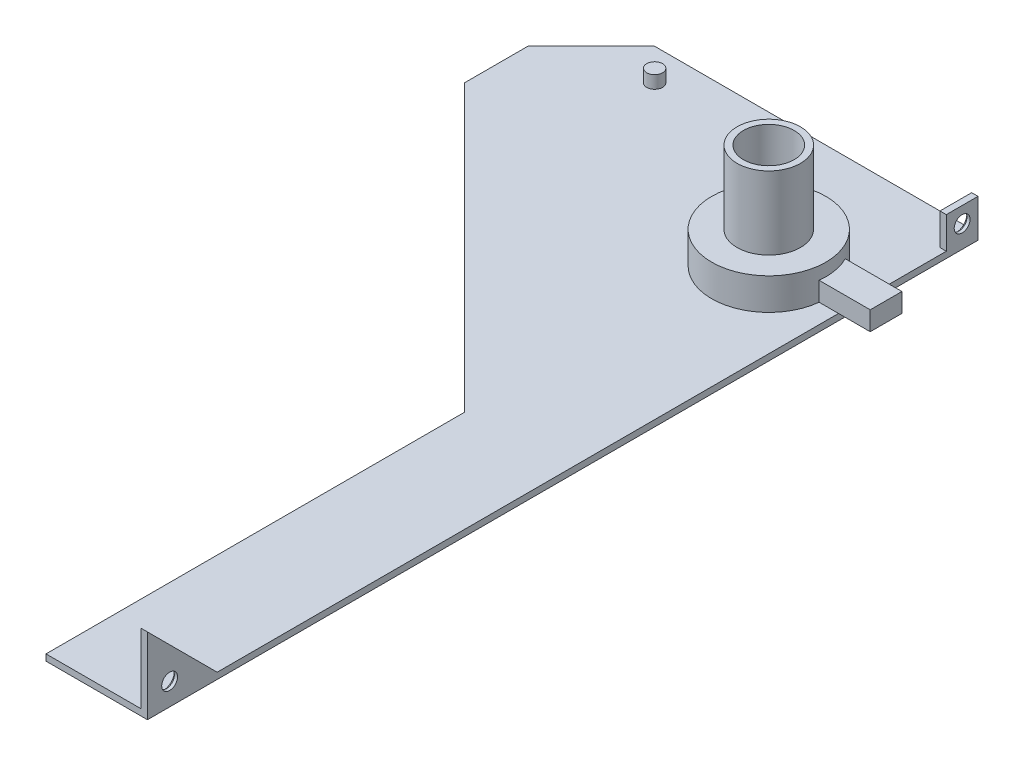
ISO-10303-21;
HEADER;
FILE_DESCRIPTION(('STEP AP214'),'2;1');
FILE_NAME('part.step','',(''),(''),'','','');
FILE_SCHEMA(('AUTOMOTIVE_DESIGN { 1 0 10303 214 1 1 1 1 }'));
ENDSEC;
DATA;
#1=APPLICATION_CONTEXT('core data for automotive mechanical design processes');
#2=APPLICATION_PROTOCOL_DEFINITION('international standard','automotive_design',2000,#1);
#3=PRODUCT_CONTEXT('',#1,'mechanical');
#4=PRODUCT('Part','Part','',(#3));
#5=PRODUCT_RELATED_PRODUCT_CATEGORY('part','',(#4));
#6=PRODUCT_DEFINITION_FORMATION('','',#4);
#7=PRODUCT_DEFINITION_CONTEXT('part definition',#1,'design');
#8=PRODUCT_DEFINITION('design','',#6,#7);
#9=PRODUCT_DEFINITION_SHAPE('','',#8);
#10=(LENGTH_UNIT() NAMED_UNIT(*) SI_UNIT(.MILLI.,.METRE.));
#11=(NAMED_UNIT(*) PLANE_ANGLE_UNIT() SI_UNIT($,.RADIAN.));
#12=(NAMED_UNIT(*) SI_UNIT($,.STERADIAN.) SOLID_ANGLE_UNIT());
#13=UNCERTAINTY_MEASURE_WITH_UNIT(LENGTH_MEASURE(1.E-05),#10,'distance_accuracy_value','');
#14=(GEOMETRIC_REPRESENTATION_CONTEXT(3) GLOBAL_UNCERTAINTY_ASSIGNED_CONTEXT((#13)) GLOBAL_UNIT_ASSIGNED_CONTEXT((#10,
#11,#12)) REPRESENTATION_CONTEXT('',''));
#15=CARTESIAN_POINT('',(0.,0.,0.));
#16=DIRECTION('',(0.,0.,1.));
#17=DIRECTION('',(1.,0.,0.));
#18=AXIS2_PLACEMENT_3D('',#15,#16,#17);
#19=CARTESIAN_POINT('',(-27.94,15.24,-6.56456621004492));
#20=DIRECTION('',(0.,1.,0.));
#21=DIRECTION('',(0.,0.,1.));
#22=AXIS2_PLACEMENT_3D('',#19,#20,#21);
#23=PLANE('',#22);
#24=CARTESIAN_POINT('',(-27.94,15.24,-6.56456621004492));
#25=DIRECTION('',(0.,1.,0.));
#26=DIRECTION('',(0.,0.,1.));
#27=AXIS2_PLACEMENT_3D('',#24,#25,#26);
#28=CIRCLE('',#27,22.86);
#29=CARTESIAN_POINT('',(-27.94,15.24,16.2954337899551));
#30=VERTEX_POINT('',#29);
#31=EDGE_CURVE('E198',#30,#30,#28,.T.);
#32=ORIENTED_EDGE('',*,*,#31,.T.);
#33=EDGE_LOOP('',(#32));
#34=FACE_BOUND('',#33,.T.);
#35=CARTESIAN_POINT('',(-27.94,15.24,-6.56456621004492));
#36=DIRECTION('',(0.,1.,0.));
#37=DIRECTION('',(0.,0.,1.));
#38=AXIS2_PLACEMENT_3D('',#35,#36,#37);
#39=CIRCLE('',#38,12.7);
#40=CARTESIAN_POINT('',(-27.94,15.24,-19.2645662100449));
#41=VERTEX_POINT('',#40);
#42=EDGE_CURVE('E189',#41,#41,#39,.T.);
#43=ORIENTED_EDGE('',*,*,#42,.F.);
#44=EDGE_LOOP('',(#43));
#45=FACE_BOUND('',#44,.T.);
#46=ADVANCED_FACE('F34',(#34,#45),#23,.T.);
#47=CARTESIAN_POINT('',(0.,8.88999999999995,263.945433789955));
#48=DIRECTION('',(-1.,0.,0.));
#49=DIRECTION('',(0.,0.,1.));
#50=AXIS2_PLACEMENT_3D('',#47,#48,#49);
#51=CONICAL_SURFACE('',#50,4.44500000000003,0.785398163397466);
#52=CARTESIAN_POINT('',(1.27000000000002,8.88999999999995,263.945433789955));
#53=DIRECTION('',(-1.,0.,0.));
#54=DIRECTION('',(0.,0.,1.));
#55=AXIS2_PLACEMENT_3D('',#52,#53,#54);
#56=CIRCLE('',#55,3.17499999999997);
#57=CARTESIAN_POINT('',(1.27000000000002,8.88999999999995,267.120433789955));
#58=VERTEX_POINT('',#57);
#59=EDGE_CURVE('E313',#58,#58,#56,.T.);
#60=ORIENTED_EDGE('',*,*,#59,.F.);
#61=EDGE_LOOP('',(#60));
#62=FACE_BOUND('',#61,.T.);
#63=CARTESIAN_POINT('',(0.,8.88999999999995,263.945433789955));
#64=DIRECTION('',(-1.,0.,0.));
#65=DIRECTION('',(0.,0.,1.));
#66=AXIS2_PLACEMENT_3D('',#63,#64,#65);
#67=CIRCLE('',#66,4.44500000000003);
#68=CARTESIAN_POINT('',(0.,8.88999999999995,268.390433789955));
#69=VERTEX_POINT('',#68);
#70=EDGE_CURVE('E310',#69,#69,#67,.F.);
#71=ORIENTED_EDGE('',*,*,#70,.F.);
#72=EDGE_LOOP('',(#71));
#73=FACE_BOUND('',#72,.T.);
#74=ADVANCED_FACE('F37',(#62,#73),#51,.F.);
#75=CARTESIAN_POINT('',(0.,8.89,-53.5545662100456));
#76=DIRECTION('',(-1.,0.,0.));
#77=DIRECTION('',(0.,0.,1.));
#78=AXIS2_PLACEMENT_3D('',#75,#76,#77);
#79=CONICAL_SURFACE('',#78,4.44499999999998,0.785398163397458);
#80=CARTESIAN_POINT('',(1.26999999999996,8.89,-53.5545662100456));
#81=DIRECTION('',(1.,0.,0.));
#82=DIRECTION('',(0.,0.,-1.));
#83=AXIS2_PLACEMENT_3D('',#80,#81,#82);
#84=CIRCLE('',#83,3.175);
#85=CARTESIAN_POINT('',(1.26999999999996,8.89,-56.7295662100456));
#86=VERTEX_POINT('',#85);
#87=EDGE_CURVE('E307',#86,#86,#84,.F.);
#88=ORIENTED_EDGE('',*,*,#87,.F.);
#89=EDGE_LOOP('',(#88));
#90=FACE_BOUND('',#89,.T.);
#91=CARTESIAN_POINT('',(0.,8.89,-53.5545662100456));
#92=DIRECTION('',(1.,0.,0.));
#93=DIRECTION('',(0.,0.,-1.));
#94=AXIS2_PLACEMENT_3D('',#91,#92,#93);
#95=CIRCLE('',#94,4.44499999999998);
#96=CARTESIAN_POINT('',(0.,8.89,-57.9995662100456));
#97=VERTEX_POINT('',#96);
#98=EDGE_CURVE('E304',#97,#97,#95,.T.);
#99=ORIENTED_EDGE('',*,*,#98,.F.);
#100=EDGE_LOOP('',(#99));
#101=FACE_BOUND('',#100,.T.);
#102=ADVANCED_FACE('F408',(#90,#101),#79,.F.);
#103=CARTESIAN_POINT('',(0.,8.88999999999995,263.945433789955));
#104=DIRECTION('',(1.,0.,0.));
#105=DIRECTION('',(0.,0.,-1.));
#106=AXIS2_PLACEMENT_3D('',#103,#104,#105);
#107=CYLINDRICAL_SURFACE('',#106,3.17499999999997);
#108=ORIENTED_EDGE('',*,*,#59,.T.);
#109=EDGE_LOOP('',(#108));
#110=FACE_BOUND('',#109,.T.);
#111=CARTESIAN_POINT('',(2.54,8.88999999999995,263.945433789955));
#112=DIRECTION('',(1.,0.,0.));
#113=DIRECTION('',(0.,0.,-1.));
#114=AXIS2_PLACEMENT_3D('',#111,#112,#113);
#115=CIRCLE('',#114,3.17499999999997);
#116=CARTESIAN_POINT('',(2.54,8.88999999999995,260.770433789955));
#117=VERTEX_POINT('',#116);
#118=EDGE_CURVE('E205',#117,#117,#115,.T.);
#119=ORIENTED_EDGE('',*,*,#118,.T.);
#120=EDGE_LOOP('',(#119));
#121=FACE_BOUND('',#120,.T.);
#122=ADVANCED_FACE('F419',(#110,#121),#107,.F.);
#123=CARTESIAN_POINT('',(0.,8.89,-53.5545662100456));
#124=DIRECTION('',(1.,0.,0.));
#125=DIRECTION('',(0.,0.,-1.));
#126=AXIS2_PLACEMENT_3D('',#123,#124,#125);
#127=CYLINDRICAL_SURFACE('',#126,3.175);
#128=ORIENTED_EDGE('',*,*,#87,.T.);
#129=EDGE_LOOP('',(#128));
#130=FACE_BOUND('',#129,.T.);
#131=CARTESIAN_POINT('',(2.54,8.89,-53.5545662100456));
#132=DIRECTION('',(1.,0.,0.));
#133=DIRECTION('',(0.,0.,-1.));
#134=AXIS2_PLACEMENT_3D('',#131,#132,#133);
#135=CIRCLE('',#134,3.175);
#136=CARTESIAN_POINT('',(2.54,8.89,-56.7295662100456));
#137=VERTEX_POINT('',#136);
#138=EDGE_CURVE('E204',#137,#137,#135,.T.);
#139=ORIENTED_EDGE('',*,*,#138,.T.);
#140=EDGE_LOOP('',(#139));
#141=FACE_BOUND('',#140,.T.);
#142=ADVANCED_FACE('F422',(#130,#141),#127,.F.);
#143=CARTESIAN_POINT('',(0.,15.24,-59.9045662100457));
#144=DIRECTION('',(0.,1.,0.));
#145=DIRECTION('',(0.,0.,1.));
#146=AXIS2_PLACEMENT_3D('',#143,#144,#145);
#147=PLANE('',#146);
#148=DIRECTION('',(0.,0.,1.));
#149=VECTOR('',#148,1.);
#150=CARTESIAN_POINT('',(2.54,15.24,-59.9045662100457));
#151=LINE('',#150,#149);
#152=CARTESIAN_POINT('',(2.54,15.24,-59.9045662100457));
#153=VERTEX_POINT('',#152);
#154=CARTESIAN_POINT('',(2.54,15.24,-47.2045662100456));
#155=VERTEX_POINT('',#154);
#156=EDGE_CURVE('E208',#153,#155,#151,.T.);
#157=ORIENTED_EDGE('',*,*,#156,.F.);
#158=DIRECTION('',(1.,0.,0.));
#159=VECTOR('',#158,1.);
#160=CARTESIAN_POINT('',(0.,15.24,-59.9045662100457));
#161=LINE('',#160,#159);
#162=CARTESIAN_POINT('',(0.,15.24,-59.9045662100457));
#163=VERTEX_POINT('',#162);
#164=EDGE_CURVE('E222',#163,#153,#161,.T.);
#165=ORIENTED_EDGE('',*,*,#164,.F.);
#166=DIRECTION('',(0.,0.,1.));
#167=VECTOR('',#166,1.);
#168=CARTESIAN_POINT('',(0.,15.24,-59.9045662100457));
#169=LINE('',#168,#167);
#170=CARTESIAN_POINT('',(0.,15.24,-47.2045662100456));
#171=VERTEX_POINT('',#170);
#172=EDGE_CURVE('E214',#163,#171,#169,.T.);
#173=ORIENTED_EDGE('',*,*,#172,.T.);
#174=DIRECTION('',(1.,0.,0.));
#175=VECTOR('',#174,1.);
#176=CARTESIAN_POINT('',(0.,15.24,-47.2045662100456));
#177=LINE('',#176,#175);
#178=EDGE_CURVE('E229',#171,#155,#177,.T.);
#179=ORIENTED_EDGE('',*,*,#178,.T.);
#180=EDGE_LOOP('',(#157,#165,#173,#179));
#181=FACE_BOUND('',#180,.T.);
#182=ADVANCED_FACE('F347',(#181),#147,.T.);
#183=CARTESIAN_POINT('',(0.,0.,0.));
#184=DIRECTION('',(0.,-1.,0.));
#185=DIRECTION('',(0.,0.,-1.));
#186=AXIS2_PLACEMENT_3D('',#183,#184,#185);
#187=PLANE('',#186);
#188=DIRECTION('',(0.,0.,1.));
#189=VECTOR('',#188,1.);
#190=CARTESIAN_POINT('',(-38.1,0.,37.4988379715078));
#191=LINE('',#190,#189);
#192=CARTESIAN_POINT('',(-38.1,0.,105.195433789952));
#193=VERTEX_POINT('',#192);
#194=CARTESIAN_POINT('',(-38.1,0.,272.835433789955));
#195=VERTEX_POINT('',#194);
#196=EDGE_CURVE('E279',#193,#195,#191,.T.);
#197=ORIENTED_EDGE('',*,*,#196,.F.);
#198=DIRECTION('',(-0.707106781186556,0.,-0.707106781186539));
#199=VECTOR('',#198,1.);
#200=CARTESIAN_POINT('',(-152.4,0.,-9.10456621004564));
#201=LINE('',#200,#199);
#202=CARTESIAN_POINT('',(-152.4,0.,-9.10456621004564));
#203=VERTEX_POINT('',#202);
#204=EDGE_CURVE('E244',#193,#203,#201,.T.);
#205=ORIENTED_EDGE('',*,*,#204,.T.);
#206=DIRECTION('',(0.,0.,-1.));
#207=VECTOR('',#206,1.);
#208=CARTESIAN_POINT('',(-152.4,0.,-34.5045662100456));
#209=LINE('',#208,#207);
#210=CARTESIAN_POINT('',(-152.4,0.,-34.5045662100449));
#211=VERTEX_POINT('',#210);
#212=EDGE_CURVE('E241',#203,#211,#209,.T.);
#213=ORIENTED_EDGE('',*,*,#212,.T.);
#214=DIRECTION('',(-0.707106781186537,0.,0.707106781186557));
#215=VECTOR('',#214,1.);
#216=CARTESIAN_POINT('',(-152.4,0.,-34.5045662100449));
#217=LINE('',#216,#215);
#218=CARTESIAN_POINT('',(-127.,0.,-59.9045662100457));
#219=VERTEX_POINT('',#218);
#220=EDGE_CURVE('E254',#219,#211,#217,.T.);
#221=ORIENTED_EDGE('',*,*,#220,.F.);
#222=DIRECTION('',(-1.,0.,0.));
#223=VECTOR('',#222,1.);
#224=CARTESIAN_POINT('',(2.54,0.,-59.9045662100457));
#225=LINE('',#224,#223);
#226=CARTESIAN_POINT('',(2.54,0.,-59.9045662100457));
#227=VERTEX_POINT('',#226);
#228=EDGE_CURVE('E276',#227,#219,#225,.T.);
#229=ORIENTED_EDGE('',*,*,#228,.F.);
#230=DIRECTION('',(0.,0.,-1.));
#231=VECTOR('',#230,1.);
#232=CARTESIAN_POINT('',(2.54,0.,-34.5045662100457));
#233=LINE('',#232,#231);
#234=CARTESIAN_POINT('',(2.54,0.,272.835433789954));
#235=VERTEX_POINT('',#234);
#236=EDGE_CURVE('E273',#235,#227,#233,.T.);
#237=ORIENTED_EDGE('',*,*,#236,.F.);
#238=DIRECTION('',(1.,0.,0.));
#239=VECTOR('',#238,1.);
#240=CARTESIAN_POINT('',(0.,0.,272.835433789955));
#241=LINE('',#240,#239);
#242=EDGE_CURVE('E281',#195,#235,#241,.T.);
#243=ORIENTED_EDGE('',*,*,#242,.F.);
#244=EDGE_LOOP('',(#197,#205,#213,#221,#229,#237,#243));
#245=FACE_BOUND('',#244,.T.);
#246=ADVANCED_FACE('F364',(#245),#187,.T.);
#247=CARTESIAN_POINT('',(-114.3,7.62,-47.2045662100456));
#248=DIRECTION('',(0.,1.,0.));
#249=DIRECTION('',(0.,0.,1.));
#250=AXIS2_PLACEMENT_3D('',#247,#248,#249);
#251=PLANE('',#250);
#252=CARTESIAN_POINT('',(-114.3,7.62,-47.2045662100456));
#253=DIRECTION('',(0.,1.,0.));
#254=DIRECTION('',(0.,0.,1.));
#255=AXIS2_PLACEMENT_3D('',#252,#253,#254);
#256=CIRCLE('',#255,3.175);
#257=CARTESIAN_POINT('',(-114.3,7.62,-44.0295662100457));
#258=VERTEX_POINT('',#257);
#259=EDGE_CURVE('E260',#258,#258,#256,.T.);
#260=ORIENTED_EDGE('',*,*,#259,.T.);
#261=EDGE_LOOP('',(#260));
#262=FACE_BOUND('',#261,.T.);
#263=ADVANCED_FACE('F392',(#262),#251,.T.);
#264=CARTESIAN_POINT('',(2.54,2.53999999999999,244.895433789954));
#265=DIRECTION('',(0.,0.707106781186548,-0.707106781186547));
#266=DIRECTION('',(0.,0.707106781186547,0.707106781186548));
#267=AXIS2_PLACEMENT_3D('',#264,#265,#266);
#268=PLANE('',#267);
#269=DIRECTION('',(1.,0.,0.));
#270=VECTOR('',#269,1.);
#271=CARTESIAN_POINT('',(0.,2.54,244.895433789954));
#272=LINE('',#271,#270);
#273=CARTESIAN_POINT('',(0.,2.53999999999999,244.895433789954));
#274=VERTEX_POINT('',#273);
#275=CARTESIAN_POINT('',(2.54,2.54,244.895433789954));
#276=VERTEX_POINT('',#275);
#277=EDGE_CURVE('E297',#274,#276,#272,.T.);
#278=ORIENTED_EDGE('',*,*,#277,.F.);
#279=DIRECTION('',(0.,-0.707106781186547,-0.707106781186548));
#280=VECTOR('',#279,1.);
#281=CARTESIAN_POINT('',(0.,2.53999999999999,244.895433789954));
#282=LINE('',#281,#280);
#283=CARTESIAN_POINT('',(0.,30.4800000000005,272.835433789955));
#284=VERTEX_POINT('',#283);
#285=EDGE_CURVE('E234',#284,#274,#282,.T.);
#286=ORIENTED_EDGE('',*,*,#285,.F.);
#287=DIRECTION('',(1.,0.,0.));
#288=VECTOR('',#287,1.);
#289=CARTESIAN_POINT('',(0.,30.4800000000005,272.835433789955));
#290=LINE('',#289,#288);
#291=CARTESIAN_POINT('',(2.54,30.4800000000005,272.835433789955));
#292=VERTEX_POINT('',#291);
#293=EDGE_CURVE('E201',#284,#292,#290,.T.);
#294=ORIENTED_EDGE('',*,*,#293,.T.);
#295=DIRECTION('',(0.,-0.707106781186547,-0.707106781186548));
#296=VECTOR('',#295,1.);
#297=CARTESIAN_POINT('',(2.54,2.53999999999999,244.895433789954));
#298=LINE('',#297,#296);
#299=EDGE_CURVE('E235',#292,#276,#298,.T.);
#300=ORIENTED_EDGE('',*,*,#299,.T.);
#301=EDGE_LOOP('',(#278,#286,#294,#300));
#302=FACE_BOUND('',#301,.T.);
#303=ADVANCED_FACE('F389',(#302),#268,.T.);
#304=CARTESIAN_POINT('',(0.,0.,0.));
#305=DIRECTION('',(-1.,0.,0.));
#306=DIRECTION('',(0.,0.,1.));
#307=AXIS2_PLACEMENT_3D('',#304,#305,#306);
#308=PLANE('',#307);
#309=DIRECTION('',(0.,-1.,0.));
#310=VECTOR('',#309,1.);
#311=CARTESIAN_POINT('',(0.,2.53999999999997,272.835433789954));
#312=LINE('',#311,#310);
#313=CARTESIAN_POINT('',(0.,2.54,272.835433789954));
#314=VERTEX_POINT('',#313);
#315=EDGE_CURVE('E237',#284,#314,#312,.T.);
#316=ORIENTED_EDGE('',*,*,#315,.F.);
#317=ORIENTED_EDGE('',*,*,#285,.T.);
#318=DIRECTION('',(0.,0.,-1.));
#319=VECTOR('',#318,1.);
#320=CARTESIAN_POINT('',(0.,2.54,0.));
#321=LINE('',#320,#319);
#322=EDGE_CURVE('E301',#314,#274,#321,.T.);
#323=ORIENTED_EDGE('',*,*,#322,.F.);
#324=EDGE_LOOP('',(#316,#317,#323));
#325=FACE_BOUND('',#324,.T.);
#326=ORIENTED_EDGE('',*,*,#70,.T.);
#327=EDGE_LOOP('',(#326));
#328=FACE_BOUND('',#327,.T.);
#329=ADVANCED_FACE('F386',(#325,#328),#308,.T.);
#330=CARTESIAN_POINT('',(0.,0.,272.835433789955));
#331=DIRECTION('',(0.,0.,1.));
#332=DIRECTION('',(1.,0.,0.));
#333=AXIS2_PLACEMENT_3D('',#330,#331,#332);
#334=PLANE('',#333);
#335=ORIENTED_EDGE('',*,*,#293,.F.);
#336=ORIENTED_EDGE('',*,*,#315,.T.);
#337=DIRECTION('',(1.,0.,0.));
#338=VECTOR('',#337,1.);
#339=CARTESIAN_POINT('',(0.,2.54,272.835433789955));
#340=LINE('',#339,#338);
#341=CARTESIAN_POINT('',(-38.1,2.54,272.835433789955));
#342=VERTEX_POINT('',#341);
#343=EDGE_CURVE('E277',#342,#314,#340,.T.);
#344=ORIENTED_EDGE('',*,*,#343,.F.);
#345=DIRECTION('',(0.,1.,0.));
#346=VECTOR('',#345,1.);
#347=CARTESIAN_POINT('',(-38.1,0.,272.835433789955));
#348=LINE('',#347,#346);
#349=EDGE_CURVE('E294',#195,#342,#348,.T.);
#350=ORIENTED_EDGE('',*,*,#349,.F.);
#351=ORIENTED_EDGE('',*,*,#242,.T.);
#352=DIRECTION('',(0.,-1.,0.));
#353=VECTOR('',#352,1.);
#354=CARTESIAN_POINT('',(2.54,2.53999999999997,272.835433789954));
#355=LINE('',#354,#353);
#356=EDGE_CURVE('E228',#292,#235,#355,.T.);
#357=ORIENTED_EDGE('',*,*,#356,.F.);
#358=EDGE_LOOP('',(#335,#336,#344,#350,#351,#357));
#359=FACE_BOUND('',#358,.T.);
#360=ADVANCED_FACE('F382',(#359),#334,.T.);
#361=CARTESIAN_POINT('',(-38.1,0.,37.4988379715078));
#362=DIRECTION('',(-1.,0.,0.));
#363=DIRECTION('',(0.,0.,1.));
#364=AXIS2_PLACEMENT_3D('',#361,#362,#363);
#365=PLANE('',#364);
#366=DIRECTION('',(0.,0.,1.));
#367=VECTOR('',#366,1.);
#368=CARTESIAN_POINT('',(-38.1,2.54,37.4988379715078));
#369=LINE('',#368,#367);
#370=CARTESIAN_POINT('',(-38.1,2.54,105.195433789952));
#371=VERTEX_POINT('',#370);
#372=EDGE_CURVE('E290',#371,#342,#369,.T.);
#373=ORIENTED_EDGE('',*,*,#372,.F.);
#374=DIRECTION('',(0.,-1.,0.));
#375=VECTOR('',#374,1.);
#376=CARTESIAN_POINT('',(-38.1,0.,105.195433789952));
#377=LINE('',#376,#375);
#378=EDGE_CURVE('E269',#371,#193,#377,.T.);
#379=ORIENTED_EDGE('',*,*,#378,.T.);
#380=ORIENTED_EDGE('',*,*,#196,.T.);
#381=ORIENTED_EDGE('',*,*,#349,.T.);
#382=EDGE_LOOP('',(#373,#379,#380,#381));
#383=FACE_BOUND('',#382,.T.);
#384=ADVANCED_FACE('F376',(#383),#365,.T.);
#385=CARTESIAN_POINT('',(-152.4,0.,-9.10456621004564));
#386=DIRECTION('',(0.707106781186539,0.,-0.707106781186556));
#387=DIRECTION('',(-0.707106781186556,0.,-0.707106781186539));
#388=AXIS2_PLACEMENT_3D('',#385,#386,#387);
#389=PLANE('',#388);
#390=ORIENTED_EDGE('',*,*,#378,.F.);
#391=DIRECTION('',(-0.707106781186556,0.,-0.707106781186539));
#392=VECTOR('',#391,1.);
#393=CARTESIAN_POINT('',(-152.4,2.54,-9.10456621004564));
#394=LINE('',#393,#392);
#395=CARTESIAN_POINT('',(-152.4,2.54,-9.10456621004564));
#396=VERTEX_POINT('',#395);
#397=EDGE_CURVE('E245',#371,#396,#394,.T.);
#398=ORIENTED_EDGE('',*,*,#397,.T.);
#399=DIRECTION('',(0.,1.,0.));
#400=VECTOR('',#399,1.);
#401=CARTESIAN_POINT('',(-152.4,0.,-9.10456621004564));
#402=LINE('',#401,#400);
#403=EDGE_CURVE('E247',#203,#396,#402,.T.);
#404=ORIENTED_EDGE('',*,*,#403,.F.);
#405=ORIENTED_EDGE('',*,*,#204,.F.);
#406=EDGE_LOOP('',(#390,#398,#404,#405));
#407=FACE_BOUND('',#406,.T.);
#408=ADVANCED_FACE('F372',(#407),#389,.F.);
#409=CARTESIAN_POINT('',(-152.4,0.,-34.5045662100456));
#410=DIRECTION('',(1.,0.,0.));
#411=DIRECTION('',(0.,0.,-1.));
#412=AXIS2_PLACEMENT_3D('',#409,#410,#411);
#413=PLANE('',#412);
#414=DIRECTION('',(0.,0.,-1.));
#415=VECTOR('',#414,1.);
#416=CARTESIAN_POINT('',(-152.4,2.54,-34.5045662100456));
#417=LINE('',#416,#415);
#418=CARTESIAN_POINT('',(-152.4,2.54,-34.5045662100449));
#419=VERTEX_POINT('',#418);
#420=EDGE_CURVE('E240',#396,#419,#417,.T.);
#421=ORIENTED_EDGE('',*,*,#420,.T.);
#422=DIRECTION('',(0.,1.,0.));
#423=VECTOR('',#422,1.);
#424=CARTESIAN_POINT('',(-152.4,0.,-34.5045662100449));
#425=LINE('',#424,#423);
#426=EDGE_CURVE('E256',#211,#419,#425,.T.);
#427=ORIENTED_EDGE('',*,*,#426,.F.);
#428=ORIENTED_EDGE('',*,*,#212,.F.);
#429=ORIENTED_EDGE('',*,*,#403,.T.);
#430=EDGE_LOOP('',(#421,#427,#428,#429));
#431=FACE_BOUND('',#430,.T.);
#432=ADVANCED_FACE('F369',(#431),#413,.F.);
#433=CARTESIAN_POINT('',(-152.4,0.,-34.5045662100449));
#434=DIRECTION('',(-0.707106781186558,0.,-0.707106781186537));
#435=DIRECTION('',(-0.707106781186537,0.,0.707106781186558));
#436=AXIS2_PLACEMENT_3D('',#433,#434,#435);
#437=PLANE('',#436);
#438=DIRECTION('',(-0.707106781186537,0.,0.707106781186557));
#439=VECTOR('',#438,1.);
#440=CARTESIAN_POINT('',(-152.4,2.54,-34.5045662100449));
#441=LINE('',#440,#439);
#442=CARTESIAN_POINT('',(-127.,2.54,-59.9045662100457));
#443=VERTEX_POINT('',#442);
#444=EDGE_CURVE('E253',#443,#419,#441,.T.);
#445=ORIENTED_EDGE('',*,*,#444,.F.);
#446=DIRECTION('',(0.,1.,0.));
#447=VECTOR('',#446,1.);
#448=CARTESIAN_POINT('',(-127.,2.54,-59.9045662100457));
#449=LINE('',#448,#447);
#450=EDGE_CURVE('E263',#219,#443,#449,.T.);
#451=ORIENTED_EDGE('',*,*,#450,.F.);
#452=ORIENTED_EDGE('',*,*,#220,.T.);
#453=ORIENTED_EDGE('',*,*,#426,.T.);
#454=EDGE_LOOP('',(#445,#451,#452,#453));
#455=FACE_BOUND('',#454,.T.);
#456=ADVANCED_FACE('F360',(#455),#437,.T.);
#457=CARTESIAN_POINT('',(0.,0.,-59.9045662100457));
#458=DIRECTION('',(0.,0.,-1.));
#459=DIRECTION('',(-1.,0.,0.));
#460=AXIS2_PLACEMENT_3D('',#457,#458,#459);
#461=PLANE('',#460);
#462=DIRECTION('',(-1.,0.,0.));
#463=VECTOR('',#462,1.);
#464=CARTESIAN_POINT('',(0.,2.54,-59.9045662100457));
#465=LINE('',#464,#463);
#466=CARTESIAN_POINT('',(0.,2.54,-59.9045662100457));
#467=VERTEX_POINT('',#466);
#468=EDGE_CURVE('E288',#467,#443,#465,.T.);
#469=ORIENTED_EDGE('',*,*,#468,.F.);
#470=DIRECTION('',(0.,1.,0.));
#471=VECTOR('',#470,1.);
#472=CARTESIAN_POINT('',(0.,2.54,-59.9045662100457));
#473=LINE('',#472,#471);
#474=EDGE_CURVE('E211',#467,#163,#473,.T.);
#475=ORIENTED_EDGE('',*,*,#474,.T.);
#476=ORIENTED_EDGE('',*,*,#164,.T.);
#477=DIRECTION('',(0.,1.,0.));
#478=VECTOR('',#477,1.);
#479=CARTESIAN_POINT('',(2.54,0.,-59.9045662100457));
#480=LINE('',#479,#478);
#481=EDGE_CURVE('E284',#227,#153,#480,.T.);
#482=ORIENTED_EDGE('',*,*,#481,.F.);
#483=ORIENTED_EDGE('',*,*,#228,.T.);
#484=ORIENTED_EDGE('',*,*,#450,.T.);
#485=EDGE_LOOP('',(#469,#475,#476,#482,#483,#484));
#486=FACE_BOUND('',#485,.T.);
#487=ADVANCED_FACE('F355',(#486),#461,.T.);
#488=CARTESIAN_POINT('',(0.,0.,0.));
#489=DIRECTION('',(1.,0.,0.));
#490=DIRECTION('',(0.,0.,-1.));
#491=AXIS2_PLACEMENT_3D('',#488,#489,#490);
#492=PLANE('',#491);
#493=ORIENTED_EDGE('',*,*,#98,.T.);
#494=EDGE_LOOP('',(#493));
#495=FACE_BOUND('',#494,.T.);
#496=ORIENTED_EDGE('',*,*,#474,.F.);
#497=DIRECTION('',(0.,0.,-1.));
#498=VECTOR('',#497,1.);
#499=CARTESIAN_POINT('',(0.,2.54,-59.9045662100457));
#500=LINE('',#499,#498);
#501=CARTESIAN_POINT('',(0.,2.54,-47.2045662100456));
#502=VERTEX_POINT('',#501);
#503=EDGE_CURVE('E220',#502,#467,#500,.T.);
#504=ORIENTED_EDGE('',*,*,#503,.F.);
#505=DIRECTION('',(0.,-1.,0.));
#506=VECTOR('',#505,1.);
#507=CARTESIAN_POINT('',(0.,2.54,-47.2045662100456));
#508=LINE('',#507,#506);
#509=EDGE_CURVE('E218',#171,#502,#508,.T.);
#510=ORIENTED_EDGE('',*,*,#509,.F.);
#511=ORIENTED_EDGE('',*,*,#172,.F.);
#512=EDGE_LOOP('',(#496,#504,#510,#511));
#513=FACE_BOUND('',#512,.T.);
#514=ADVANCED_FACE('F351',(#495,#513),#492,.F.);
#515=CARTESIAN_POINT('',(0.,2.54,-47.2045662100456));
#516=DIRECTION('',(0.,0.,1.));
#517=DIRECTION('',(1.,0.,0.));
#518=AXIS2_PLACEMENT_3D('',#515,#516,#517);
#519=PLANE('',#518);
#520=DIRECTION('',(0.,-1.,0.));
#521=VECTOR('',#520,1.);
#522=CARTESIAN_POINT('',(2.54,2.54,-47.2045662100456));
#523=LINE('',#522,#521);
#524=CARTESIAN_POINT('',(2.54,2.54,-47.2045662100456));
#525=VERTEX_POINT('',#524);
#526=EDGE_CURVE('E215',#155,#525,#523,.T.);
#527=ORIENTED_EDGE('',*,*,#526,.F.);
#528=ORIENTED_EDGE('',*,*,#178,.F.);
#529=ORIENTED_EDGE('',*,*,#509,.T.);
#530=DIRECTION('',(1.,0.,0.));
#531=VECTOR('',#530,1.);
#532=CARTESIAN_POINT('',(0.,2.54,-47.2045662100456));
#533=LINE('',#532,#531);
#534=EDGE_CURVE('E58',#502,#525,#533,.T.);
#535=ORIENTED_EDGE('',*,*,#534,.T.);
#536=EDGE_LOOP('',(#527,#528,#529,#535));
#537=FACE_BOUND('',#536,.T.);
#538=ADVANCED_FACE('F342',(#537),#519,.T.);
#539=CARTESIAN_POINT('',(2.54,0.,-34.5045662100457));
#540=DIRECTION('',(1.,0.,0.));
#541=DIRECTION('',(0.,0.,-1.));
#542=AXIS2_PLACEMENT_3D('',#539,#540,#541);
#543=PLANE('',#542);
#544=ORIENTED_EDGE('',*,*,#299,.F.);
#545=ORIENTED_EDGE('',*,*,#356,.T.);
#546=ORIENTED_EDGE('',*,*,#236,.T.);
#547=ORIENTED_EDGE('',*,*,#481,.T.);
#548=ORIENTED_EDGE('',*,*,#156,.T.);
#549=ORIENTED_EDGE('',*,*,#526,.T.);
#550=DIRECTION('',(0.,0.,-1.));
#551=VECTOR('',#550,1.);
#552=CARTESIAN_POINT('',(2.54,2.54,-34.5045662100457));
#553=LINE('',#552,#551);
#554=CARTESIAN_POINT('',(2.54,2.54,-16.7245662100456));
#555=VERTEX_POINT('',#554);
#556=EDGE_CURVE('E272',#555,#525,#553,.T.);
#557=ORIENTED_EDGE('',*,*,#556,.F.);
#558=DIRECTION('',(0.,0.,-1.));
#559=VECTOR('',#558,1.);
#560=CARTESIAN_POINT('',(2.54,2.54,-34.5045662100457));
#561=LINE('',#560,#559);
#562=CARTESIAN_POINT('',(2.54,2.54,-4.02456621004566));
#563=VERTEX_POINT('',#562);
#564=EDGE_CURVE('E184',#563,#555,#561,.T.);
#565=ORIENTED_EDGE('',*,*,#564,.F.);
#566=EDGE_CURVE('E285',#276,#563,#553,.T.);
#567=ORIENTED_EDGE('',*,*,#566,.F.);
#568=EDGE_LOOP('',(#544,#545,#546,#547,#548,#549,#557,#565,#567));
#569=FACE_BOUND('',#568,.T.);
#570=ORIENTED_EDGE('',*,*,#138,.F.);
#571=EDGE_LOOP('',(#570));
#572=FACE_BOUND('',#571,.T.);
#573=ORIENTED_EDGE('',*,*,#118,.F.);
#574=EDGE_LOOP('',(#573));
#575=FACE_BOUND('',#574,.T.);
#576=ADVANCED_FACE('F335',(#569,#572,#575),#543,.T.);
#577=CARTESIAN_POINT('',(-114.3,7.62,-47.2045662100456));
#578=DIRECTION('',(0.,-1.,0.));
#579=DIRECTION('',(0.,0.,-1.));
#580=AXIS2_PLACEMENT_3D('',#577,#578,#579);
#581=CYLINDRICAL_SURFACE('',#580,3.175);
#582=ORIENTED_EDGE('',*,*,#259,.F.);
#583=EDGE_LOOP('',(#582));
#584=FACE_BOUND('',#583,.T.);
#585=CARTESIAN_POINT('',(-114.3,2.54,-47.2045662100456));
#586=DIRECTION('',(0.,-1.,0.));
#587=DIRECTION('',(0.,0.,-1.));
#588=AXIS2_PLACEMENT_3D('',#585,#586,#587);
#589=CIRCLE('',#588,3.175);
#590=CARTESIAN_POINT('',(-114.3,2.54,-50.3795662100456));
#591=VERTEX_POINT('',#590);
#592=EDGE_CURVE('E266',#591,#591,#589,.F.);
#593=ORIENTED_EDGE('',*,*,#592,.T.);
#594=EDGE_LOOP('',(#593));
#595=FACE_BOUND('',#594,.T.);
#596=ADVANCED_FACE('F440',(#584,#595),#581,.T.);
#597=CARTESIAN_POINT('',(0.,2.54,0.));
#598=DIRECTION('',(0.,-1.,0.));
#599=DIRECTION('',(0.,0.,-1.));
#600=AXIS2_PLACEMENT_3D('',#597,#598,#599);
#601=PLANE('',#600);
#602=CARTESIAN_POINT('',(-27.94,2.54,-6.56456621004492));
#603=DIRECTION('',(0.,-1.,0.));
#604=DIRECTION('',(0.,0.,-1.));
#605=AXIS2_PLACEMENT_3D('',#602,#603,#604);
#606=CIRCLE('',#605,22.86);
#607=CARTESIAN_POINT('',(-7.46186531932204,2.54,-16.7245662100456));
#608=VERTEX_POINT('',#607);
#609=CARTESIAN_POINT('',(-5.22154934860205,2.54,-4.02456621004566));
#610=VERTEX_POINT('',#609);
#611=EDGE_CURVE('E316',#608,#610,#606,.F.);
#612=ORIENTED_EDGE('',*,*,#611,.F.);
#613=DIRECTION('',(1.,0.,0.));
#614=VECTOR('',#613,1.);
#615=CARTESIAN_POINT('',(-10.16,2.54,-16.7245662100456));
#616=LINE('',#615,#614);
#617=EDGE_CURVE('E179',#608,#555,#616,.T.);
#618=ORIENTED_EDGE('',*,*,#617,.T.);
#619=ORIENTED_EDGE('',*,*,#556,.T.);
#620=ORIENTED_EDGE('',*,*,#534,.F.);
#621=ORIENTED_EDGE('',*,*,#503,.T.);
#622=ORIENTED_EDGE('',*,*,#468,.T.);
#623=ORIENTED_EDGE('',*,*,#444,.T.);
#624=ORIENTED_EDGE('',*,*,#420,.F.);
#625=ORIENTED_EDGE('',*,*,#397,.F.);
#626=ORIENTED_EDGE('',*,*,#372,.T.);
#627=ORIENTED_EDGE('',*,*,#343,.T.);
#628=ORIENTED_EDGE('',*,*,#322,.T.);
#629=ORIENTED_EDGE('',*,*,#277,.T.);
#630=ORIENTED_EDGE('',*,*,#566,.T.);
#631=DIRECTION('',(1.,0.,0.));
#632=VECTOR('',#631,1.);
#633=CARTESIAN_POINT('',(-10.16,2.54,-4.02456621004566));
#634=LINE('',#633,#632);
#635=EDGE_CURVE('E180',#610,#563,#634,.T.);
#636=ORIENTED_EDGE('',*,*,#635,.F.);
#637=EDGE_LOOP('',(#612,#618,#619,#620,#621,#622,#623,#624,#625,#626,#627,#628,#629,#630,#636));
#638=FACE_BOUND('',#637,.T.);
#639=ORIENTED_EDGE('',*,*,#592,.F.);
#640=EDGE_LOOP('',(#639));
#641=FACE_BOUND('',#640,.T.);
#642=ADVANCED_FACE('F329',(#638,#641),#601,.F.);
#643=CARTESIAN_POINT('',(-27.94,15.24,-6.56456621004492));
#644=DIRECTION('',(0.,-1.,0.));
#645=DIRECTION('',(0.,0.,-1.));
#646=AXIS2_PLACEMENT_3D('',#643,#644,#645);
#647=CYLINDRICAL_SURFACE('',#646,22.86);
#648=ORIENTED_EDGE('',*,*,#31,.F.);
#649=EDGE_LOOP('',(#648));
#650=FACE_BOUND('',#649,.T.);
#651=CARTESIAN_POINT('',(-27.94,10.16,-6.56456621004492));
#652=DIRECTION('',(0.,1.,0.));
#653=DIRECTION('',(0.,0.,1.));
#654=AXIS2_PLACEMENT_3D('',#651,#652,#653);
#655=CIRCLE('',#654,22.86);
#656=CARTESIAN_POINT('',(-5.22154934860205,10.16,-4.02456621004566));
#657=VERTEX_POINT('',#656);
#658=CARTESIAN_POINT('',(-7.46186531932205,10.16,-16.7245662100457));
#659=VERTEX_POINT('',#658);
#660=EDGE_CURVE('E319',#657,#659,#655,.T.);
#661=ORIENTED_EDGE('',*,*,#660,.T.);
#662=DIRECTION('',(0.,-1.,0.));
#663=VECTOR('',#662,1.);
#664=CARTESIAN_POINT('',(-7.46186531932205,15.24,-16.7245662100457));
#665=LINE('',#664,#663);
#666=EDGE_CURVE('E11',#659,#608,#665,.T.);
#667=ORIENTED_EDGE('',*,*,#666,.T.);
#668=ORIENTED_EDGE('',*,*,#611,.T.);
#669=DIRECTION('',(0.,-1.,0.));
#670=VECTOR('',#669,1.);
#671=CARTESIAN_POINT('',(-5.22154934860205,15.24,-4.02456621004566));
#672=LINE('',#671,#670);
#673=EDGE_CURVE('E43',#610,#657,#672,.F.);
#674=ORIENTED_EDGE('',*,*,#673,.T.);
#675=EDGE_LOOP('',(#661,#667,#668,#674));
#676=FACE_BOUND('',#675,.T.);
#677=ADVANCED_FACE('F322',(#650,#676),#647,.T.);
#678=CARTESIAN_POINT('',(-27.94,44.45,-6.56456621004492));
#679=DIRECTION('',(0.,1.,0.));
#680=DIRECTION('',(0.,0.,1.));
#681=AXIS2_PLACEMENT_3D('',#678,#679,#680);
#682=PLANE('',#681);
#683=CARTESIAN_POINT('',(-27.94,44.45,-6.56456621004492));
#684=DIRECTION('',(0.,1.,0.));
#685=DIRECTION('',(0.,0.,1.));
#686=AXIS2_PLACEMENT_3D('',#683,#684,#685);
#687=CIRCLE('',#686,12.7);
#688=CARTESIAN_POINT('',(-27.94,44.45,-19.2645662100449));
#689=VERTEX_POINT('',#688);
#690=EDGE_CURVE('E190',#689,#689,#687,.T.);
#691=ORIENTED_EDGE('',*,*,#690,.T.);
#692=EDGE_LOOP('',(#691));
#693=FACE_BOUND('',#692,.T.);
#694=CARTESIAN_POINT('',(-27.94,44.45,-6.56456621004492));
#695=DIRECTION('',(0.,1.,0.));
#696=DIRECTION('',(0.,0.,1.));
#697=AXIS2_PLACEMENT_3D('',#694,#695,#696);
#698=CIRCLE('',#697,10.16);
#699=CARTESIAN_POINT('',(-27.94,44.45,3.59543378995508));
#700=VERTEX_POINT('',#699);
#701=EDGE_CURVE('E186',#700,#700,#698,.T.);
#702=ORIENTED_EDGE('',*,*,#701,.F.);
#703=EDGE_LOOP('',(#702));
#704=FACE_BOUND('',#703,.T.);
#705=ADVANCED_FACE('F417',(#693,#704),#682,.T.);
#706=CARTESIAN_POINT('',(-27.94,44.45,-6.56456621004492));
#707=DIRECTION('',(0.,-1.,0.));
#708=DIRECTION('',(0.,0.,-1.));
#709=AXIS2_PLACEMENT_3D('',#706,#707,#708);
#710=CYLINDRICAL_SURFACE('',#709,12.7);
#711=CARTESIAN_POINT('',(-27.94,44.45,-19.2645662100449));
#712=CARTESIAN_POINT('',(-27.94,44.1457291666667,-19.2645662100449));
#713=CARTESIAN_POINT('',(-27.94,43.8414583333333,-19.2645662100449));
#714=CARTESIAN_POINT('',(-27.94,43.2329166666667,-19.2645662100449));
#715=CARTESIAN_POINT('',(-27.94,42.9286458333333,-19.2645662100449));
#716=CARTESIAN_POINT('',(-27.94,42.3201041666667,-19.2645662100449));
#717=CARTESIAN_POINT('',(-27.94,42.0158333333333,-19.2645662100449));
#718=CARTESIAN_POINT('',(-27.94,41.4072916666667,-19.2645662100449));
#719=CARTESIAN_POINT('',(-27.94,41.1030208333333,-19.2645662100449));
#720=CARTESIAN_POINT('',(-27.94,40.4944791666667,-19.2645662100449));
#721=CARTESIAN_POINT('',(-27.94,40.1902083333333,-19.2645662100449));
#722=CARTESIAN_POINT('',(-27.94,39.5816666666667,-19.2645662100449));
#723=CARTESIAN_POINT('',(-27.94,39.2773958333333,-19.2645662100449));
#724=CARTESIAN_POINT('',(-27.94,38.6688541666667,-19.2645662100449));
#725=CARTESIAN_POINT('',(-27.94,38.3645833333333,-19.2645662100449));
#726=CARTESIAN_POINT('',(-27.94,37.7560416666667,-19.2645662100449));
#727=CARTESIAN_POINT('',(-27.94,37.4517708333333,-19.2645662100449));
#728=CARTESIAN_POINT('',(-27.94,36.8432291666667,-19.2645662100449));
#729=CARTESIAN_POINT('',(-27.94,36.5389583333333,-19.2645662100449));
#730=CARTESIAN_POINT('',(-27.94,35.9304166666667,-19.2645662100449));
#731=CARTESIAN_POINT('',(-27.94,35.6261458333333,-19.2645662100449));
#732=CARTESIAN_POINT('',(-27.94,35.0176041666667,-19.2645662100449));
#733=CARTESIAN_POINT('',(-27.94,34.7133333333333,-19.2645662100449));
#734=CARTESIAN_POINT('',(-27.94,34.1047916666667,-19.2645662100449));
#735=CARTESIAN_POINT('',(-27.94,33.8005208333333,-19.2645662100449));
#736=CARTESIAN_POINT('',(-27.94,33.1919791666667,-19.2645662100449));
#737=CARTESIAN_POINT('',(-27.94,32.8877083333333,-19.2645662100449));
#738=CARTESIAN_POINT('',(-27.94,32.2791666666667,-19.2645662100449));
#739=CARTESIAN_POINT('',(-27.94,31.9748958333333,-19.2645662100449));
#740=CARTESIAN_POINT('',(-27.94,31.3663541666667,-19.2645662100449));
#741=CARTESIAN_POINT('',(-27.94,31.0620833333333,-19.2645662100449));
#742=CARTESIAN_POINT('',(-27.94,30.4535416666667,-19.2645662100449));
#743=CARTESIAN_POINT('',(-27.94,30.1492708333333,-19.2645662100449));
#744=CARTESIAN_POINT('',(-27.94,29.5407291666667,-19.2645662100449));
#745=CARTESIAN_POINT('',(-27.94,29.2364583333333,-19.2645662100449));
#746=CARTESIAN_POINT('',(-27.94,28.6279166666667,-19.2645662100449));
#747=CARTESIAN_POINT('',(-27.94,28.3236458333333,-19.2645662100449));
#748=CARTESIAN_POINT('',(-27.94,27.7151041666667,-19.2645662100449));
#749=CARTESIAN_POINT('',(-27.94,27.4108333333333,-19.2645662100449));
#750=CARTESIAN_POINT('',(-27.94,26.8022916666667,-19.2645662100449));
#751=CARTESIAN_POINT('',(-27.94,26.4980208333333,-19.2645662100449));
#752=CARTESIAN_POINT('',(-27.94,25.8894791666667,-19.2645662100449));
#753=CARTESIAN_POINT('',(-27.94,25.5852083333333,-19.2645662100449));
#754=CARTESIAN_POINT('',(-27.94,24.9766666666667,-19.2645662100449));
#755=CARTESIAN_POINT('',(-27.94,24.6723958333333,-19.2645662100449));
#756=CARTESIAN_POINT('',(-27.94,24.0638541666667,-19.2645662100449));
#757=CARTESIAN_POINT('',(-27.94,23.7595833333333,-19.2645662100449));
#758=CARTESIAN_POINT('',(-27.94,23.1510416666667,-19.2645662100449));
#759=CARTESIAN_POINT('',(-27.94,22.8467708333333,-19.2645662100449));
#760=CARTESIAN_POINT('',(-27.94,22.2382291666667,-19.2645662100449));
#761=CARTESIAN_POINT('',(-27.94,21.9339583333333,-19.2645662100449));
#762=CARTESIAN_POINT('',(-27.94,21.3254166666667,-19.2645662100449));
#763=CARTESIAN_POINT('',(-27.94,21.0211458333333,-19.2645662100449));
#764=CARTESIAN_POINT('',(-27.94,20.4126041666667,-19.2645662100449));
#765=CARTESIAN_POINT('',(-27.94,20.1083333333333,-19.2645662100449));
#766=CARTESIAN_POINT('',(-27.94,19.4997916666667,-19.2645662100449));
#767=CARTESIAN_POINT('',(-27.94,19.1955208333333,-19.2645662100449));
#768=CARTESIAN_POINT('',(-27.94,18.5869791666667,-19.2645662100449));
#769=CARTESIAN_POINT('',(-27.94,18.2827083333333,-19.2645662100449));
#770=CARTESIAN_POINT('',(-27.94,17.6741666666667,-19.2645662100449));
#771=CARTESIAN_POINT('',(-27.94,17.3698958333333,-19.2645662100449));
#772=CARTESIAN_POINT('',(-27.94,16.7613541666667,-19.2645662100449));
#773=CARTESIAN_POINT('',(-27.94,16.4570833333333,-19.2645662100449));
#774=CARTESIAN_POINT('',(-27.94,15.8485416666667,-19.2645662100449));
#775=CARTESIAN_POINT('',(-27.94,15.5442708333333,-19.2645662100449));
#776=CARTESIAN_POINT('',(-27.94,15.24,-19.2645662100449));
#777=B_SPLINE_CURVE_WITH_KNOTS('',3,(#711,#712,#713,#714,#715,#716,#717,#718,#719,#720,#721,
#722,#723,#724,#725,#726,#727,#728,#729,#730,#731,#732,#733,#734,#735,#736,#737,#738,#739,#740,
#741,#742,#743,#744,#745,#746,#747,#748,#749,#750,#751,#752,#753,#754,#755,#756,#757,#758,#759,
#760,#761,#762,#763,#764,#765,#766,#767,#768,#769,#770,#771,#772,#773,#774,#775,#776),
.UNSPECIFIED.,.F.,.F.,(4,2,2,2,2,2,2,2,2,2,2,2,2,2,2,2,2,2,2,2,2,2,2,2,2,2,2,2,2,2,2,2,4),(0.,
0.912812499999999,1.825625,2.7384375,3.65124999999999,4.56406249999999,5.47687499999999,
6.3896875,7.3025,8.2153125,9.12812499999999,10.0409375,10.95375,11.8665625,12.779375,13.6921875,
14.605,15.5178125,16.430625,17.3434375,18.25625,19.1690625,20.081875,20.9946875,21.9075,
22.8203125,23.733125,24.6459375,25.55875,26.4715625,27.384375,28.2971875,29.21),.UNSPECIFIED.);
#778=EDGE_CURVE('BSEAM621',#689,#41,#777,.T.);
#779=ORIENTED_EDGE('',*,*,#690,.F.);
#780=ORIENTED_EDGE('',*,*,#42,.T.);
#781=ORIENTED_EDGE('',*,*,#778,.T.);
#782=ORIENTED_EDGE('',*,*,#778,.F.);
#783=EDGE_LOOP('',(#779,#781,#780,#782));
#784=FACE_BOUND('',#783,.T.);
#785=ADVANCED_FACE('F621',(#784),#710,.T.);
#786=CARTESIAN_POINT('',(-27.94,2.54,-6.56456621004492));
#787=DIRECTION('',(0.,1.,0.));
#788=DIRECTION('',(0.,0.,1.));
#789=AXIS2_PLACEMENT_3D('',#786,#787,#788);
#790=CIRCLE('',#789,10.16);
#791=CARTESIAN_POINT('',(-27.94,2.54,3.59543378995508));
#792=VERTEX_POINT('',#791);
#793=EDGE_CURVE('E193',#792,#792,#790,.T.);
#794=ORIENTED_EDGE('',*,*,#793,.T.);
#795=EDGE_LOOP('',(#794));
#796=FACE_BOUND('',#795,.T.);
#797=ADVANCED_FACE('F443',(#796),#601,.F.);
#798=CARTESIAN_POINT('',(-27.94,15.24,-6.56456621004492));
#799=DIRECTION('',(0.,-1.,0.));
#800=DIRECTION('',(0.,0.,-1.));
#801=AXIS2_PLACEMENT_3D('',#798,#799,#800);
#802=CYLINDRICAL_SURFACE('',#801,10.16);
#803=ORIENTED_EDGE('',*,*,#793,.F.);
#804=EDGE_LOOP('',(#803));
#805=FACE_BOUND('',#804,.T.);
#806=ORIENTED_EDGE('',*,*,#701,.T.);
#807=EDGE_LOOP('',(#806));
#808=FACE_BOUND('',#807,.T.);
#809=ADVANCED_FACE('F413',(#805,#808),#802,.F.);
#810=CARTESIAN_POINT('',(-10.16,2.54,-16.7245662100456));
#811=DIRECTION('',(0.,0.,-1.));
#812=DIRECTION('',(0.,1.,0.));
#813=AXIS2_PLACEMENT_3D('',#810,#811,#812);
#814=PLANE('',#813);
#815=ORIENTED_EDGE('',*,*,#666,.F.);
#816=DIRECTION('',(1.,0.,0.));
#817=VECTOR('',#816,1.);
#818=CARTESIAN_POINT('',(-10.16,10.16,-16.7245662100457));
#819=LINE('',#818,#817);
#820=CARTESIAN_POINT('',(15.24,10.16,-16.7245662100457));
#821=VERTEX_POINT('',#820);
#822=EDGE_CURVE('E50',#659,#821,#819,.T.);
#823=ORIENTED_EDGE('',*,*,#822,.T.);
#824=DIRECTION('',(0.,1.,0.));
#825=VECTOR('',#824,1.);
#826=CARTESIAN_POINT('',(15.24,2.54,-16.7245662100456));
#827=LINE('',#826,#825);
#828=CARTESIAN_POINT('',(15.24,2.54,-16.7245662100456));
#829=VERTEX_POINT('',#828);
#830=EDGE_CURVE('E156',#829,#821,#827,.T.);
#831=ORIENTED_EDGE('',*,*,#830,.F.);
#832=EDGE_CURVE('E177',#555,#829,#616,.T.);
#833=ORIENTED_EDGE('',*,*,#832,.F.);
#834=ORIENTED_EDGE('',*,*,#617,.F.);
#835=EDGE_LOOP('',(#815,#823,#831,#833,#834));
#836=FACE_BOUND('',#835,.T.);
#837=ADVANCED_FACE('F153',(#836),#814,.T.);
#838=CARTESIAN_POINT('',(-10.16,2.54,-16.7245662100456));
#839=DIRECTION('',(0.,-1.,0.));
#840=DIRECTION('',(0.,0.,-1.));
#841=AXIS2_PLACEMENT_3D('',#838,#839,#840);
#842=PLANE('',#841);
#843=CARTESIAN_POINT('',(15.24,2.54,-4.02456621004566));
#844=VERTEX_POINT('',#843);
#845=EDGE_CURVE('E181',#563,#844,#634,.T.);
#846=ORIENTED_EDGE('',*,*,#845,.F.);
#847=ORIENTED_EDGE('',*,*,#564,.T.);
#848=ORIENTED_EDGE('',*,*,#832,.T.);
#849=DIRECTION('',(0.,0.,-1.));
#850=VECTOR('',#849,1.);
#851=CARTESIAN_POINT('',(15.24,2.54,-16.7245662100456));
#852=LINE('',#851,#850);
#853=EDGE_CURVE('E159',#844,#829,#852,.T.);
#854=ORIENTED_EDGE('',*,*,#853,.F.);
#855=EDGE_LOOP('',(#846,#847,#848,#854));
#856=FACE_BOUND('',#855,.T.);
#857=ADVANCED_FACE('F339',(#856),#842,.T.);
#858=CARTESIAN_POINT('',(-10.16,2.54,-4.02456621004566));
#859=DIRECTION('',(0.,0.,1.));
#860=DIRECTION('',(1.,0.,0.));
#861=AXIS2_PLACEMENT_3D('',#858,#859,#860);
#862=PLANE('',#861);
#863=ORIENTED_EDGE('',*,*,#673,.F.);
#864=ORIENTED_EDGE('',*,*,#635,.T.);
#865=ORIENTED_EDGE('',*,*,#845,.T.);
#866=DIRECTION('',(0.,-1.,0.));
#867=VECTOR('',#866,1.);
#868=CARTESIAN_POINT('',(15.24,2.54,-4.02456621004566));
#869=LINE('',#868,#867);
#870=CARTESIAN_POINT('',(15.24,10.16,-4.02456621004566));
#871=VERTEX_POINT('',#870);
#872=EDGE_CURVE('E168',#871,#844,#869,.T.);
#873=ORIENTED_EDGE('',*,*,#872,.F.);
#874=DIRECTION('',(1.,0.,0.));
#875=VECTOR('',#874,1.);
#876=CARTESIAN_POINT('',(-10.16,10.16,-4.02456621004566));
#877=LINE('',#876,#875);
#878=EDGE_CURVE('E158',#657,#871,#877,.T.);
#879=ORIENTED_EDGE('',*,*,#878,.F.);
#880=EDGE_LOOP('',(#863,#864,#865,#873,#879));
#881=FACE_BOUND('',#880,.T.);
#882=ADVANCED_FACE('F327',(#881),#862,.T.);
#883=CARTESIAN_POINT('',(-10.16,10.16,-16.7245662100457));
#884=DIRECTION('',(0.,1.,0.));
#885=DIRECTION('',(0.,0.,1.));
#886=AXIS2_PLACEMENT_3D('',#883,#884,#885);
#887=PLANE('',#886);
#888=ORIENTED_EDGE('',*,*,#660,.F.);
#889=ORIENTED_EDGE('',*,*,#878,.T.);
#890=DIRECTION('',(0.,0.,1.));
#891=VECTOR('',#890,1.);
#892=CARTESIAN_POINT('',(15.24,10.16,-16.7245662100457));
#893=LINE('',#892,#891);
#894=EDGE_CURVE('E162',#821,#871,#893,.T.);
#895=ORIENTED_EDGE('',*,*,#894,.F.);
#896=ORIENTED_EDGE('',*,*,#822,.F.);
#897=EDGE_LOOP('',(#888,#889,#895,#896));
#898=FACE_BOUND('',#897,.T.);
#899=ADVANCED_FACE('F163',(#898),#887,.T.);
#900=CARTESIAN_POINT('',(15.24,0.,0.));
#901=DIRECTION('',(1.,0.,0.));
#902=DIRECTION('',(0.,0.,-1.));
#903=AXIS2_PLACEMENT_3D('',#900,#901,#902);
#904=PLANE('',#903);
#905=ORIENTED_EDGE('',*,*,#830,.T.);
#906=ORIENTED_EDGE('',*,*,#894,.T.);
#907=ORIENTED_EDGE('',*,*,#872,.T.);
#908=ORIENTED_EDGE('',*,*,#853,.T.);
#909=EDGE_LOOP('',(#905,#906,#907,#908));
#910=FACE_BOUND('',#909,.T.);
#911=ADVANCED_FACE('F171',(#910),#904,.T.);
#912=CLOSED_SHELL('',(#46,#74,#102,#122,#142,#182,#246,#263,#303,#329,#360,#384,#408,#432,#456,
#487,#514,#538,#576,#596,#642,#677,#705,#785,#797,#809,#837,#857,#882,#899,#911));
#913=MANIFOLD_SOLID_BREP('B2',#912);
#914=ADVANCED_BREP_SHAPE_REPRESENTATION('',(#18,#913),#14);
#915=SHAPE_DEFINITION_REPRESENTATION(#9,#914);
ENDSEC;
END-ISO-10303-21;
